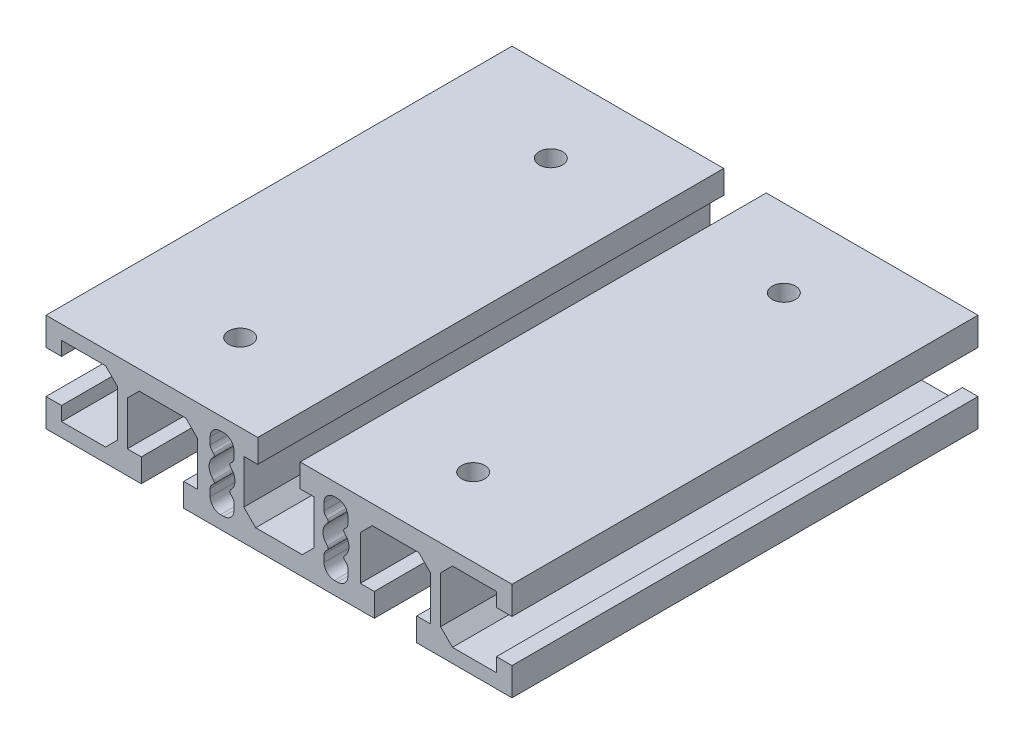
from build123d import *

# Parameters (mm, degrees)
BOSS_EXTRUDE1_DEPTH      = 45
BOSS_EXTRUDE1_DEPTH_BACK = 45
SKETCH2_R                = 2.25
CUT_EXTRUDE1_DEPTH       = 45


with BuildPart() as part:
    # Sketch1 → Boss-Extrude1 (new, two sides: drawn at the far end of the back side and taken through both)
    with BuildSketch(Plane.XY.offset(-BOSS_EXTRUDE1_DEPTH_BACK)):
        Polygon((-15.7, 3.5), (-15.7, -5), (-18.4, -5), (-18.4, -9.5), (18.4, -9.5), (18.4, -5), (15.7, -5), (15.7, 3.5), (18, 5.8), (27, 5.8), (29.3, 3.5), (29.3, -5), (26.6, -5), (26.6, -9.5), (45, -9.5), (45, -4.1), (42, -4.1), (42, -6.8), (33.5, -6.8), (31.2, -4.5), (31.2, 4.5), (33.5, 6.8), (42, 6.8), (42, 4.1), (45, 4.1), (45, 9.5), (4.1, 9.5), (4.1, 5), (6.8, 5), (6.8, -3.5), (4.5, -5.8), (-4.5, -5.8), (-6.8, -3.5), (-6.8, 5), (-4.1, 5), (-4.1, 9.5), (-45, 9.5), (-45, 4.1), (-42, 4.1), (-42, 6.8), (-33.5, 6.8), (-31.2, 4.5), (-31.2, -4.5), (-33.5, -6.8), (-42, -6.8), (-42, -4.1), (-45, -4.1), (-45, -9.5), (-26.6, -9.5), (-26.6, -5), (-29.3, -5), (-29.3, 3.5), (-27, 5.8), (-18, 5.8), align=None)
        with BuildLine():
            Line((-13.299970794, -4.999975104), (-13.299970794, -3.657373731))
            ThreePointArc((-13.299970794, -3.657373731), (-13.223850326, -3.274690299), (-13.007077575, -2.95026695))
            Line((-13.007077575, -2.95026695), (-12.646417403, -2.589606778))
            ThreePointArc((-12.646417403, -2.589606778), (-12.500164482, -2.222137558), (-12.66663746, -1.863375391))
            ThreePointArc((-12.66663746, -1.863375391), (-13.499970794, 1.459e-05), (-12.66663746, 1.863404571))
            ThreePointArc((-12.66663746, 1.863404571), (-12.500164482, 2.222166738), (-12.646417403, 2.589635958))
            Line((-12.646417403, 2.589635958), (-13.007077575, 2.95029613))
            ThreePointArc((-13.007077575, 2.95029613), (-13.223850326, 3.274719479), (-13.299970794, 3.657402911))
            Line((-13.299970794, 3.657402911), (-13.299970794, 5.000004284))
            ThreePointArc((-13.299970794, 5.000004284), (-12.714184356, 6.414217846), (-11.299970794, 7.000004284))
            Line((-11.299970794, 7.000004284), (-10.699970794, 7.000004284))
            ThreePointArc((-10.699970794, 7.000004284), (-9.285757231, 6.414217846), (-8.699970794, 5.000004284))
            Line((-8.699970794, 5.000004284), (-8.699970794, 3.657402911))
            ThreePointArc((-8.699970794, 3.657402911), (-8.776091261, 3.274719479), (-8.992864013, 2.95029613))
            Line((-8.992864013, 2.95029613), (-9.353524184, 2.589635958))
            ThreePointArc((-9.353524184, 2.589635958), (-9.499777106, 2.222166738), (-9.333304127, 1.863404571))
            ThreePointArc((-9.333304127, 1.863404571), (-8.499970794, 1.459e-05), (-9.333304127, -1.863375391))
            ThreePointArc((-9.333304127, -1.863375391), (-9.499777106, -2.222137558), (-9.353524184, -2.589606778))
            Line((-9.353524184, -2.589606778), (-8.992864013, -2.95026695))
            ThreePointArc((-8.992864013, -2.95026695), (-8.776091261, -3.274690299), (-8.699970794, -3.657373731))
            Line((-8.699970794, -3.657373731), (-8.699970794, -4.999975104))
            ThreePointArc((-8.699970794, -4.999975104), (-9.285757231, -6.414188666), (-10.699970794, -6.999975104))
            Line((-10.699970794, -6.999975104), (-11.299970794, -6.999975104))
            ThreePointArc((-11.299970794, -6.999975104), (-12.714184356, -6.414188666), (-13.299970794, -4.999975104))
        make_face(mode=Mode.SUBTRACT)
        with BuildLine():
            Line((13.007077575, 2.95029613), (12.646417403, 2.589635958))
            ThreePointArc((12.646417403, 2.589635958), (12.500164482, 2.222166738), (12.66663746, 1.863404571))
            ThreePointArc((12.66663746, 1.863404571), (13.499970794, 1.459e-05), (12.66663746, -1.863375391))
            ThreePointArc((12.66663746, -1.863375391), (12.500164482, -2.222137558), (12.646417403, -2.589606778))
            Line((12.646417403, -2.589606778), (13.007077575, -2.95026695))
            ThreePointArc((13.007077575, -2.95026695), (13.223850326, -3.274690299), (13.299970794, -3.657373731))
            Line((13.299970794, -3.657373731), (13.299970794, -4.999975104))
            ThreePointArc((13.299970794, -4.999975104), (12.714184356, -6.414188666), (11.299970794, -6.999975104))
            Line((11.299970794, -6.999975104), (10.699970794, -6.999975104))
            ThreePointArc((10.699970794, -6.999975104), (9.285757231, -6.414188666), (8.699970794, -4.999975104))
            Line((8.699970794, -4.999975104), (8.699970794, -3.657373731))
            ThreePointArc((8.699970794, -3.657373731), (8.776091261, -3.274690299), (8.992864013, -2.95026695))
            Line((8.992864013, -2.95026695), (9.353524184, -2.589606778))
            ThreePointArc((9.353524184, -2.589606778), (9.499777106, -2.222137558), (9.333304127, -1.863375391))
            ThreePointArc((9.333304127, -1.863375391), (8.499970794, 1.459e-05), (9.333304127, 1.863404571))
            ThreePointArc((9.333304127, 1.863404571), (9.499777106, 2.222166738), (9.353524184, 2.589635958))
            Line((9.353524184, 2.589635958), (8.992864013, 2.95029613))
            ThreePointArc((8.992864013, 2.95029613), (8.776091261, 3.274719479), (8.699970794, 3.657402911))
            Line((8.699970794, 3.657402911), (8.699970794, 5.000004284))
            ThreePointArc((8.699970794, 5.000004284), (9.285757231, 6.414217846), (10.699970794, 7.000004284))
            Line((10.699970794, 7.000004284), (11.299970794, 7.000004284))
            ThreePointArc((11.299970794, 7.000004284), (12.714184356, 6.414217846), (13.299970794, 5.000004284))
            Line((13.299970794, 5.000004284), (13.299970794, 3.657402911))
            ThreePointArc((13.299970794, 3.657402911), (13.223850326, 3.274719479), (13.007077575, 2.95029613))
        make_face(mode=Mode.SUBTRACT)
    extrude(amount=BOSS_EXTRUDE1_DEPTH + BOSS_EXTRUDE1_DEPTH_BACK)

    # Sketch2 → Cut-Extrude1 (cut)
    with BuildSketch(Plane(origin=(0, 9.5, 0), x_dir=(1, 0, 0), z_dir=(0, 1, 0))):
        with Locations(Location((-22.5, 30, 0), (0, 0, 270))):
            Circle(SKETCH2_R)
        with Locations(Location((-22.5, -30, 0), (0, 0, 270))):
            Circle(SKETCH2_R)
        with Locations(Location((22.5, -30, 0), (0, 0, 270))):
            Circle(SKETCH2_R)
        with Locations(Location((22.5, 30, 0), (0, 0, 270))):
            Circle(SKETCH2_R)
    extrude(amount=-CUT_EXTRUDE1_DEPTH, mode=Mode.SUBTRACT)


solid = part.part
